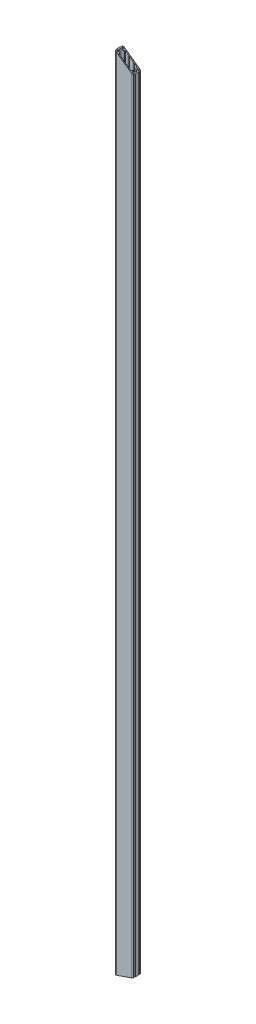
from build123d import *

# Parameters (mm, degrees)
SALIENTE_EXTRUIR1_DEPTH = 7940
CORTAR_EXTRUIR4_DEPTH   = 7941.91304574
CORTAR_EXTRUIR5_DEPTH   = 7941.91304574


with BuildPart() as part:
    # Croquis2 → Saliente-Extruir1 (new body)
    with BuildSketch(Plane(origin=(0, 0, 0), x_dir=(1, 0, 0), z_dir=(0, 1, 0))):
        with BuildLine():
            Line((90, -15.820430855), (90, 15.820430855))
            ThreePointArc((90, 15.820430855), (86.377431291, 21.479059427), (79.722019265, 20.557879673))
            ThreePointArc((79.722019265, 20.557879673), (69.104845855, 26.662756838), (81.19143785, 28.639671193))
            ThreePointArc((81.19143785, 28.639671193), (86.625966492, 27.069353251), (88.196284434, 32.503881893))
            ThreePointArc((88.196284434, 32.503881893), (82.872032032, 37.986118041), (75.5, 40))
            Line((75.5, 40), (-75.5, 40))
            ThreePointArc((-75.5, 40), (-82.872032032, 37.986118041), (-88.196284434, 32.503881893))
            ThreePointArc((-88.196284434, 32.503881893), (-86.625966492, 27.069353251), (-81.19143785, 28.639671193))
            ThreePointArc((-81.19143785, 28.639671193), (-69.104845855, 26.662756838), (-79.722019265, 20.557879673))
            ThreePointArc((-79.722019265, 20.557879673), (-86.377431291, 21.479059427), (-90, 15.820430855))
            Line((-90, 15.820430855), (-90, -15.820430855))
            ThreePointArc((-90, -15.820430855), (-86.377431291, -21.479059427), (-79.722019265, -20.557879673))
            ThreePointArc((-79.722019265, -20.557879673), (-69.104845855, -26.662756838), (-81.19143785, -28.639671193))
            ThreePointArc((-81.19143785, -28.639671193), (-86.625966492, -27.069353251), (-88.196284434, -32.503881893))
            ThreePointArc((-88.196284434, -32.503881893), (-82.872032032, -37.986118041), (-75.5, -40))
            Line((-75.5, -40), (75.5, -40))
            ThreePointArc((75.5, -40), (82.872032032, -37.986118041), (88.196284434, -32.503881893))
            ThreePointArc((88.196284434, -32.503881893), (86.625966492, -27.069353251), (81.19143785, -28.639671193))
            ThreePointArc((81.19143785, -28.639671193), (69.104845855, -26.662756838), (79.722019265, -20.557879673))
            ThreePointArc((79.722019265, -20.557879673), (86.377431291, -21.479059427), (90, -15.820430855))
        make_face()
        with BuildLine():
            Line((-17.482701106, 32), (17.482701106, 32))
            Line((17.482701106, 32), (20, 29))
            Line((20, 29), (30, 29))
            Line((30, 29), (32.517298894, 32))
            Line((32.517298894, 32), (54.5, 32))
            ThreePointArc((54.5, 32), (59.096194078, 30.096194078), (61, 25.5))
            ThreePointArc((61, 25.5), (65.246951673, 15.246951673), (75.5, 11))
            ThreePointArc((75.5, 11), (80.096194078, 9.096194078), (82, 4.5))
            Line((82, 4.5), (82, -4.5))
            ThreePointArc((82, -4.5), (80.096194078, -9.096194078), (75.5, -11))
            ThreePointArc((75.5, -11), (65.246951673, -15.246951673), (61, -25.5))
            ThreePointArc((61, -25.5), (59.096194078, -30.096194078), (54.5, -32))
            Line((54.5, -32), (32.517298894, -32))
            Line((32.517298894, -32), (30, -29))
            Line((30, -29), (20, -29))
            Line((20, -29), (17.482701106, -32))
            Line((17.482701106, -32), (-17.482701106, -32))
            Line((-17.482701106, -32), (-20, -29))
            Line((-20, -29), (-30, -29))
            Line((-30, -29), (-32.517298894, -32))
            Line((-32.517298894, -32), (-54.5, -32))
            ThreePointArc((-54.5, -32), (-59.096194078, -30.096194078), (-61, -25.5))
            ThreePointArc((-61, -25.5), (-65.246951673, -15.246951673), (-75.5, -11))
            ThreePointArc((-75.5, -11), (-80.096194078, -9.096194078), (-82, -4.5))
            Line((-82, -4.5), (-82, 4.5))
            ThreePointArc((-82, 4.5), (-80.096194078, 9.096194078), (-75.5, 11))
            ThreePointArc((-75.5, 11), (-65.246951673, 15.246951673), (-61, 25.5))
            ThreePointArc((-61, 25.5), (-59.096194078, 30.096194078), (-54.5, 32))
            Line((-54.5, 32), (-32.517298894, 32))
            Line((-32.517298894, 32), (-30, 29))
            Line((-30, 29), (-20, 29))
            Line((-20, 29), (-17.482701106, 32))
        make_face(mode=Mode.SUBTRACT)
    extrude(amount=SALIENTE_EXTRUIR1_DEPTH)

    # Croquis4 → Cortar-Extruir4 (cut, through all)
    with BuildSketch(Plane.XY.offset(40)):
        Polygon((90, 7811.891435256), (-90, 7940), (90, 7940), align=None)
    extrude(amount=-CORTAR_EXTRUIR4_DEPTH, mode=Mode.SUBTRACT)

    # Croquis5 → Cortar-Extruir5 (cut, through all)
    with BuildSketch(Plane.XY.offset(40)):
        Polygon((90, 62.400963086), (-90, 0), (90, 0), align=None)
    extrude(amount=-CORTAR_EXTRUIR5_DEPTH, mode=Mode.SUBTRACT)


solid = part.part
